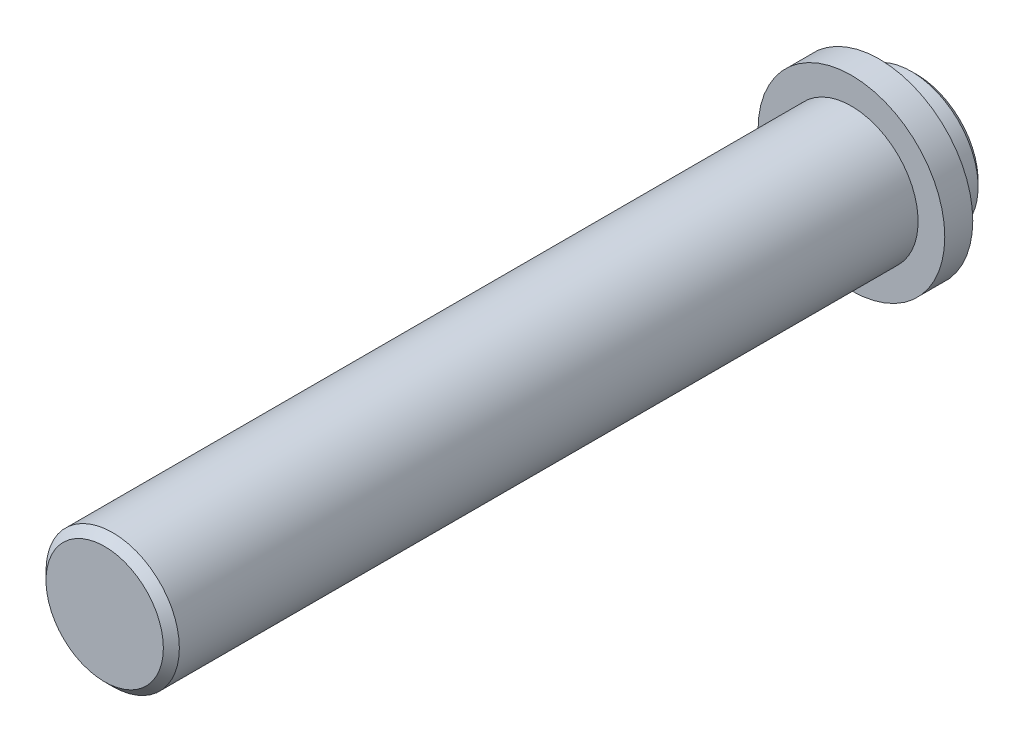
ISO-10303-21;
HEADER;
FILE_DESCRIPTION(('STEP AP214'),'2;1');
FILE_NAME('part.step','',(''),(''),'','','');
FILE_SCHEMA(('AUTOMOTIVE_DESIGN { 1 0 10303 214 1 1 1 1 }'));
ENDSEC;
DATA;
#1=APPLICATION_CONTEXT('core data for automotive mechanical design processes');
#2=APPLICATION_PROTOCOL_DEFINITION('international standard','automotive_design',2000,#1);
#3=PRODUCT_CONTEXT('',#1,'mechanical');
#4=PRODUCT('Part','Part','',(#3));
#5=PRODUCT_RELATED_PRODUCT_CATEGORY('part','',(#4));
#6=PRODUCT_DEFINITION_FORMATION('','',#4);
#7=PRODUCT_DEFINITION_CONTEXT('part definition',#1,'design');
#8=PRODUCT_DEFINITION('design','',#6,#7);
#9=PRODUCT_DEFINITION_SHAPE('','',#8);
#10=(LENGTH_UNIT() NAMED_UNIT(*) SI_UNIT(.MILLI.,.METRE.));
#11=(NAMED_UNIT(*) PLANE_ANGLE_UNIT() SI_UNIT($,.RADIAN.));
#12=(NAMED_UNIT(*) SI_UNIT($,.STERADIAN.) SOLID_ANGLE_UNIT());
#13=UNCERTAINTY_MEASURE_WITH_UNIT(LENGTH_MEASURE(1.E-05),#10,'distance_accuracy_value','');
#14=(GEOMETRIC_REPRESENTATION_CONTEXT(3) GLOBAL_UNCERTAINTY_ASSIGNED_CONTEXT((#13)) GLOBAL_UNIT_ASSIGNED_CONTEXT((#10,
#11,#12)) REPRESENTATION_CONTEXT('',''));
#15=CARTESIAN_POINT('',(0.,0.,0.));
#16=DIRECTION('',(0.,0.,1.));
#17=DIRECTION('',(1.,0.,0.));
#18=AXIS2_PLACEMENT_3D('',#15,#16,#17);
#19=CARTESIAN_POINT('',(0.,0.,-1.05));
#20=DIRECTION('',(0.,0.,-1.));
#21=DIRECTION('',(-1.,0.,0.));
#22=AXIS2_PLACEMENT_3D('',#19,#20,#21);
#23=CONICAL_SURFACE('',#22,1.5,0.785398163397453);
#24=CARTESIAN_POINT('',(-0.096702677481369,-1.6473641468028,-1.20020000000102));
#25=CARTESIAN_POINT('',(-0.141437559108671,-1.6235835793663,-1.17907878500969));
#26=CARTESIAN_POINT('',(-0.186830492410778,-1.59945319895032,-1.15957905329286));
#27=CARTESIAN_POINT('',(-0.278957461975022,-1.55047952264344,-1.12460601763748));
#28=CARTESIAN_POINT('',(-0.3256952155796,-1.52563425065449,-1.10914536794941));
#29=CARTESIAN_POINT('',(-0.419791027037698,-1.47561395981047,-1.08330353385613));
#30=CARTESIAN_POINT('',(-0.46713838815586,-1.45044462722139,-1.07287365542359));
#31=CARTESIAN_POINT('',(-0.562481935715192,-1.39976105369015,-1.05760327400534));
#32=CARTESIAN_POINT('',(-0.610477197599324,-1.37424730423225,-1.05275551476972));
#33=CARTESIAN_POINT('',(-0.70418135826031,-1.32443521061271,-1.04911164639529));
#34=CARTESIAN_POINT('',(-0.749881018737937,-1.30014177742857,-1.05001738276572));
#35=CARTESIAN_POINT('',(-0.840964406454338,-1.25172285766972,-1.05710786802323));
#36=CARTESIAN_POINT('',(-0.886347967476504,-1.22759745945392,-1.06329520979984));
#37=CARTESIAN_POINT('',(-1.02131955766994,-1.15584805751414,-1.08916841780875));
#38=CARTESIAN_POINT('',(-1.10986386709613,-1.10877888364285,-1.11616213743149));
#39=CARTESIAN_POINT('',(-1.21549251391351,-1.05262786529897,-1.15779675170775));
#40=CARTESIAN_POINT('',(-1.23486662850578,-1.04232880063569,-1.16583844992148));
#41=CARTESIAN_POINT('',(-1.27334689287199,-1.02187311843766,-1.18255570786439));
#42=CARTESIAN_POINT('',(-1.29245357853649,-1.01171621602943,-1.19122968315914));
#43=CARTESIAN_POINT('',(-1.31146313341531,-1.00161094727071,-1.20019999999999));
#44=B_SPLINE_CURVE_WITH_KNOTS('',3,(#24,#25,#26,#27,#28,#29,#30,#31,#32,#33,#34,#35,#36,#37,#38,
#39,#40,#41,#42,#43),.UNSPECIFIED.,.F.,.F.,(4,2,2,2,2,2,2,2,2,4),(0.,0.164736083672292,
0.3299822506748,0.493595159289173,0.656995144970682,0.811999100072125,0.967079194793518,
1.27678722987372,1.34689710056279,1.41683695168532),.UNSPECIFIED.);
#45=CARTESIAN_POINT('',(-0.0971264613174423,-1.64713886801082,-1.2));
#46=VERTEX_POINT('',#45);
#47=CARTESIAN_POINT('',(-1.31103934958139,-1.00183622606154,-1.2));
#48=VERTEX_POINT('',#47);
#49=EDGE_CURVE('E144',#46,#48,#44,.T.);
#50=ORIENTED_EDGE('',*,*,#49,.F.);
#51=CARTESIAN_POINT('',(0.,0.,-1.2));
#52=DIRECTION('',(0.,0.,-1.));
#53=DIRECTION('',(-1.,0.,0.));
#54=AXIS2_PLACEMENT_3D('',#51,#52,#53);
#55=CIRCLE('',#54,1.65);
#56=EDGE_CURVE('E254',#48,#46,#55,.F.);
#57=ORIENTED_EDGE('',*,*,#56,.F.);
#58=EDGE_LOOP('',(#50,#57));
#59=FACE_BOUND('',#58,.T.);
#60=ADVANCED_FACE('F30',(#59),#23,.F.);
#61=CARTESIAN_POINT('',(1.37830786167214,-0.907429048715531,-1.2002));
#62=CARTESIAN_POINT('',(1.33534584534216,-0.934280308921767,-1.17907878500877));
#63=CARTESIAN_POINT('',(1.29175185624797,-0.96152655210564,-1.15957905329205));
#64=CARTESIAN_POINT('',(1.20327592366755,-1.0168240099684,-1.12460601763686));
#65=CARTESIAN_POINT('',(1.15839041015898,-1.04487745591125,-1.10914536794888));
#66=CARTESIAN_POINT('',(1.06802366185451,-1.10135667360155,-1.08330353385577));
#67=CARTESIAN_POINT('',(1.02255269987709,-1.12977602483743,-1.07287365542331));
#68=CARTESIAN_POINT('',(0.930987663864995,-1.18700417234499,-1.0576032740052));
#69=CARTESIAN_POINT('',(0.884894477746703,-1.21581241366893,-1.05275551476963));
#70=CARTESIAN_POINT('',(0.794903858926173,-1.27205655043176,-1.04911164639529));
#71=CARTESIAN_POINT('',(0.751015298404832,-1.29948690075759,-1.05001738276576));
#72=CARTESIAN_POINT('',(0.663541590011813,-1.35415796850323,-1.05710786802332));
#73=CARTESIAN_POINT('',(0.619956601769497,-1.38139858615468,-1.06329520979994));
#74=CARTESIAN_POINT('',(0.490334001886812,-1.46241271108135,-1.08916841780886));
#75=CARTESIAN_POINT('',(0.405298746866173,-1.51555974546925,-1.11616213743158));
#76=CARTESIAN_POINT('',(0.303856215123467,-1.57896132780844,-1.15779675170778));
#77=CARTESIAN_POINT('',(0.285249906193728,-1.59059027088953,-1.16583844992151));
#78=CARTESIAN_POINT('',(0.248294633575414,-1.61368731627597,-1.18255570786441));
#79=CARTESIAN_POINT('',(0.229945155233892,-1.62515574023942,-1.19122968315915));
#80=CARTESIAN_POINT('',(0.211688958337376,-1.63656586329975,-1.20019999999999));
#81=B_SPLINE_CURVE_WITH_KNOTS('',3,(#61,#62,#63,#64,#65,#66,#67,#68,#69,#70,#71,#72,#73,#74,#75,
#76,#77,#78,#79,#80),.UNSPECIFIED.,.F.,.F.,(4,2,2,2,2,2,2,2,2,4),(0.,0.164736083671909,
0.329982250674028,0.493595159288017,0.656995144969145,0.811999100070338,0.967079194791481,
1.27678722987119,1.3468971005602,1.41683695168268),.UNSPECIFIED.);
#82=CARTESIAN_POINT('',(1.37790087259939,-0.907683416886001,-1.2));
#83=VERTEX_POINT('',#82);
#84=CARTESIAN_POINT('',(0.212095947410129,-1.63631149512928,-1.2));
#85=VERTEX_POINT('',#84);
#86=EDGE_CURVE('E286',#83,#85,#81,.T.);
#87=ORIENTED_EDGE('',*,*,#86,.F.);
#88=EDGE_CURVE('E329',#85,#83,#55,.F.);
#89=ORIENTED_EDGE('',*,*,#88,.F.);
#90=EDGE_LOOP('',(#87,#89));
#91=FACE_BOUND('',#90,.T.);
#92=ADVANCED_FACE('F342',(#91),#23,.F.);
#93=CARTESIAN_POINT('',(1.47501053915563,0.739935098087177,-1.20020000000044));
#94=CARTESIAN_POINT('',(1.47678340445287,0.689303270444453,-1.17907878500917));
#95=CARTESIAN_POINT('',(1.4785823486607,0.637926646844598,-1.1595790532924));
#96=CARTESIAN_POINT('',(1.48223338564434,0.533655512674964,-1.12460601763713));
#97=CARTESIAN_POINT('',(1.48408562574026,0.480756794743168,-1.10914536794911));
#98=CARTESIAN_POINT('',(1.4878146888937,0.374257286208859,-1.08330353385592));
#99=CARTESIAN_POINT('',(1.48969108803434,0.320668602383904,-1.07287365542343));
#100=CARTESIAN_POINT('',(1.49346959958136,0.212756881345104,-1.05760327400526));
#101=CARTESIAN_POINT('',(1.4953716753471,0.158434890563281,-1.05275551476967));
#102=CARTESIAN_POINT('',(1.49908521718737,0.0523786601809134,-1.04911164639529));
#103=CARTESIAN_POINT('',(1.50089631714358,0.000654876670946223,-1.05001738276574));
#104=CARTESIAN_POINT('',(1.50450599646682,-0.102435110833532,-1.05710786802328));
#105=CARTESIAN_POINT('',(1.50630456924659,-0.153801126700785,-1.0632952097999));
#106=CARTESIAN_POINT('',(1.51165355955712,-0.306564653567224,-1.08916841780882));
#107=CARTESIAN_POINT('',(1.51516261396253,-0.406780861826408,-1.11616213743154));
#108=CARTESIAN_POINT('',(1.51934872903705,-0.526333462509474,-1.15779675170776));
#109=CARTESIAN_POINT('',(1.52011653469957,-0.548261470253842,-1.1658384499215));
#110=CARTESIAN_POINT('',(1.52164152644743,-0.591814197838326,-1.18255570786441));
#111=CARTESIAN_POINT('',(1.52239873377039,-0.613439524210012,-1.19122968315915));
#112=CARTESIAN_POINT('',(1.52315209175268,-0.634954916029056,-1.2002));
#113=B_SPLINE_CURVE_WITH_KNOTS('',3,(#93,#94,#95,#96,#97,#98,#99,#100,#101,#102,#103,#104,#105,
#106,#107,#108,#109,#110,#111,#112),.UNSPECIFIED.,.F.,.F.,(4,2,2,2,2,2,2,2,2,4),(0.,
0.164736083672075,0.329982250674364,0.493595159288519,0.656995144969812,0.811999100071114,
0.967079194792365,1.27678722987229,1.34689710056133,1.41683695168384),.UNSPECIFIED.);
#114=CARTESIAN_POINT('',(1.47502733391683,0.739455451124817,-1.2));
#115=VERTEX_POINT('',#114);
#116=CARTESIAN_POINT('',(1.52313529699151,-0.634475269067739,-1.2));
#117=VERTEX_POINT('',#116);
#118=EDGE_CURVE('E292',#115,#117,#113,.T.);
#119=ORIENTED_EDGE('',*,*,#118,.F.);
#120=EDGE_CURVE('E326',#117,#115,#55,.F.);
#121=ORIENTED_EDGE('',*,*,#120,.F.);
#122=EDGE_LOOP('',(#119,#121));
#123=FACE_BOUND('',#122,.T.);
#124=ADVANCED_FACE('F345',(#123),#23,.F.);
#125=CARTESIAN_POINT('',(0.0967026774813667,1.6473641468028,-1.20020000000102));
#126=CARTESIAN_POINT('',(0.141437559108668,1.6235835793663,-1.17907878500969));
#127=CARTESIAN_POINT('',(0.186830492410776,1.59945319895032,-1.15957905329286));
#128=CARTESIAN_POINT('',(0.27895746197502,1.55047952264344,-1.12460601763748));
#129=CARTESIAN_POINT('',(0.325695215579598,1.52563425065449,-1.10914536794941));
#130=CARTESIAN_POINT('',(0.419791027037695,1.47561395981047,-1.08330353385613));
#131=CARTESIAN_POINT('',(0.467138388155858,1.45044462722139,-1.07287365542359));
#132=CARTESIAN_POINT('',(0.56248193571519,1.39976105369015,-1.05760327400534));
#133=CARTESIAN_POINT('',(0.610477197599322,1.37424730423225,-1.05275551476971));
#134=CARTESIAN_POINT('',(0.704181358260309,1.32443521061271,-1.04911164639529));
#135=CARTESIAN_POINT('',(0.749881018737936,1.30014177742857,-1.05001738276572));
#136=CARTESIAN_POINT('',(0.840964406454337,1.25172285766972,-1.05710786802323));
#137=CARTESIAN_POINT('',(0.886347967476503,1.22759745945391,-1.06329520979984));
#138=CARTESIAN_POINT('',(1.02131955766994,1.15584805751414,-1.08916841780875));
#139=CARTESIAN_POINT('',(1.10986386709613,1.10877888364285,-1.11616213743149));
#140=CARTESIAN_POINT('',(1.21549251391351,1.05262786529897,-1.15779675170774));
#141=CARTESIAN_POINT('',(1.23486662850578,1.04232880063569,-1.16583844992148));
#142=CARTESIAN_POINT('',(1.27334689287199,1.02187311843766,-1.18255570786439));
#143=CARTESIAN_POINT('',(1.29245357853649,1.01171621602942,-1.19122968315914));
#144=CARTESIAN_POINT('',(1.31146313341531,1.0016109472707,-1.20019999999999));
#145=B_SPLINE_CURVE_WITH_KNOTS('',3,(#125,#126,#127,#128,#129,#130,#131,#132,#133,#134,#135,
#136,#137,#138,#139,#140,#141,#142,#143,#144),.UNSPECIFIED.,.F.,.F.,(4,2,2,2,2,2,2,2,2,4),(0.,
0.164736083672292,0.3299822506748,0.493595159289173,0.656995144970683,0.811999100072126,
0.967079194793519,1.27678722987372,1.34689710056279,1.41683695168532),.UNSPECIFIED.);
#146=CARTESIAN_POINT('',(0.0971264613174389,1.64713886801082,-1.2));
#147=VERTEX_POINT('',#146);
#148=CARTESIAN_POINT('',(1.31103934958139,1.00183622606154,-1.2));
#149=VERTEX_POINT('',#148);
#150=EDGE_CURVE('E310',#147,#149,#145,.T.);
#151=ORIENTED_EDGE('',*,*,#150,.F.);
#152=EDGE_CURVE('E325',#149,#147,#55,.F.);
#153=ORIENTED_EDGE('',*,*,#152,.F.);
#154=EDGE_LOOP('',(#151,#153));
#155=FACE_BOUND('',#154,.T.);
#156=ADVANCED_FACE('F349',(#155),#23,.F.);
#157=CARTESIAN_POINT('',(-1.37830786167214,0.907429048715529,-1.2002));
#158=CARTESIAN_POINT('',(-1.33534584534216,0.934280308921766,-1.17907878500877));
#159=CARTESIAN_POINT('',(-1.29175185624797,0.961526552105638,-1.15957905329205));
#160=CARTESIAN_POINT('',(-1.20327592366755,1.0168240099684,-1.12460601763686));
#161=CARTESIAN_POINT('',(-1.15839041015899,1.04487745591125,-1.10914536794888));
#162=CARTESIAN_POINT('',(-1.06802366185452,1.10135667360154,-1.08330353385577));
#163=CARTESIAN_POINT('',(-1.0225526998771,1.12977602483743,-1.07287365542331));
#164=CARTESIAN_POINT('',(-0.930987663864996,1.18700417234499,-1.0576032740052));
#165=CARTESIAN_POINT('',(-0.884894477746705,1.21581241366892,-1.05275551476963));
#166=CARTESIAN_POINT('',(-0.794903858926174,1.27205655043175,-1.04911164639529));
#167=CARTESIAN_POINT('',(-0.751015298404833,1.29948690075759,-1.05001738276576));
#168=CARTESIAN_POINT('',(-0.663541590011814,1.35415796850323,-1.05710786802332));
#169=CARTESIAN_POINT('',(-0.619956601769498,1.38139858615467,-1.06329520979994));
#170=CARTESIAN_POINT('',(-0.490334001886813,1.46241271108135,-1.08916841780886));
#171=CARTESIAN_POINT('',(-0.405298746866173,1.51555974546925,-1.11616213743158));
#172=CARTESIAN_POINT('',(-0.303856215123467,1.57896132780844,-1.15779675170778));
#173=CARTESIAN_POINT('',(-0.285249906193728,1.59059027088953,-1.16583844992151));
#174=CARTESIAN_POINT('',(-0.248294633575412,1.61368731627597,-1.18255570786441));
#175=CARTESIAN_POINT('',(-0.22994515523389,1.62515574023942,-1.19122968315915));
#176=CARTESIAN_POINT('',(-0.211688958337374,1.63656586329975,-1.20019999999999));
#177=B_SPLINE_CURVE_WITH_KNOTS('',3,(#157,#158,#159,#160,#161,#162,#163,#164,#165,#166,#167,
#168,#169,#170,#171,#172,#173,#174,#175,#176),.UNSPECIFIED.,.F.,.F.,(4,2,2,2,2,2,2,2,2,4),(0.,
0.164736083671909,0.329982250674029,0.493595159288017,0.656995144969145,0.811999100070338,
0.967079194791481,1.27678722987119,1.3468971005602,1.41683695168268),.UNSPECIFIED.);
#178=CARTESIAN_POINT('',(-1.37790087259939,0.907683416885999,-1.2));
#179=VERTEX_POINT('',#178);
#180=CARTESIAN_POINT('',(-0.212095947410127,1.63631149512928,-1.2));
#181=VERTEX_POINT('',#180);
#182=EDGE_CURVE('E262',#179,#181,#177,.T.);
#183=ORIENTED_EDGE('',*,*,#182,.F.);
#184=EDGE_CURVE('E253',#181,#179,#55,.F.);
#185=ORIENTED_EDGE('',*,*,#184,.F.);
#186=EDGE_LOOP('',(#183,#185));
#187=FACE_BOUND('',#186,.T.);
#188=ADVANCED_FACE('F324',(#187),#23,.F.);
#189=CARTESIAN_POINT('',(0.,0.,-1.05));
#190=DIRECTION('',(0.,0.,-1.));
#191=DIRECTION('',(-1.,0.,0.));
#192=AXIS2_PLACEMENT_3D('',#189,#190,#191);
#193=PLANE('',#192);
#194=CARTESIAN_POINT('',(0.,0.,-1.05));
#195=DIRECTION('',(0.,0.,-1.));
#196=DIRECTION('',(-1.,0.,0.));
#197=AXIS2_PLACEMENT_3D('',#194,#195,#196);
#198=CIRCLE('',#197,3.5);
#199=CARTESIAN_POINT('',(-3.5,0.,-1.05));
#200=VERTEX_POINT('',#199);
#201=EDGE_CURVE('E234',#200,#200,#198,.T.);
#202=ORIENTED_EDGE('',*,*,#201,.T.);
#203=EDGE_LOOP('',(#202));
#204=FACE_BOUND('',#203,.T.);
#205=CARTESIAN_POINT('',(0.,0.,-1.05));
#206=DIRECTION('',(0.,0.,-1.));
#207=DIRECTION('',(-1.,0.,0.));
#208=AXIS2_PLACEMENT_3D('',#205,#206,#207);
#209=CIRCLE('',#208,2.5);
#210=CARTESIAN_POINT('',(-2.5,0.,-1.05));
#211=VERTEX_POINT('',#210);
#212=EDGE_CURVE('E228',#211,#211,#209,.T.);
#213=ORIENTED_EDGE('',*,*,#212,.F.);
#214=EDGE_LOOP('',(#213));
#215=FACE_BOUND('',#214,.T.);
#216=ADVANCED_FACE('F392',(#204,#215),#193,.T.);
#217=CARTESIAN_POINT('',(0.,0.,28.));
#218=DIRECTION('',(0.,0.,-1.));
#219=DIRECTION('',(-1.,0.,0.));
#220=AXIS2_PLACEMENT_3D('',#217,#218,#219);
#221=CYLINDRICAL_SURFACE('',#220,2.5);
#222=CARTESIAN_POINT('',(0.,0.,27.7));
#223=DIRECTION('',(0.,0.,1.));
#224=DIRECTION('',(1.,0.,0.));
#225=AXIS2_PLACEMENT_3D('',#222,#223,#224);
#226=CIRCLE('',#225,2.5);
#227=CARTESIAN_POINT('',(2.5,0.,27.7));
#228=VERTEX_POINT('',#227);
#229=EDGE_CURVE('E243',#228,#228,#226,.F.);
#230=ORIENTED_EDGE('',*,*,#229,.T.);
#231=EDGE_LOOP('',(#230));
#232=FACE_BOUND('',#231,.T.);
#233=CARTESIAN_POINT('',(0.,0.,0.));
#234=DIRECTION('',(0.,0.,-1.));
#235=DIRECTION('',(-1.,0.,0.));
#236=AXIS2_PLACEMENT_3D('',#233,#234,#235);
#237=CIRCLE('',#236,2.5);
#238=CARTESIAN_POINT('',(-2.5,0.,0.));
#239=VERTEX_POINT('',#238);
#240=EDGE_CURVE('E237',#239,#239,#237,.T.);
#241=ORIENTED_EDGE('',*,*,#240,.F.);
#242=EDGE_LOOP('',(#241));
#243=FACE_BOUND('',#242,.T.);
#244=ADVANCED_FACE('F32',(#232,#243),#221,.T.);
#245=CARTESIAN_POINT('',(0.,0.,28.));
#246=DIRECTION('',(0.,0.,1.));
#247=DIRECTION('',(1.,0.,0.));
#248=AXIS2_PLACEMENT_3D('',#245,#246,#247);
#249=PLANE('',#248);
#250=CARTESIAN_POINT('',(0.,0.,28.));
#251=DIRECTION('',(0.,0.,1.));
#252=DIRECTION('',(1.,0.,0.));
#253=AXIS2_PLACEMENT_3D('',#250,#251,#252);
#254=CIRCLE('',#253,2.2);
#255=CARTESIAN_POINT('',(2.2,0.,28.));
#256=VERTEX_POINT('',#255);
#257=EDGE_CURVE('E240',#256,#256,#254,.T.);
#258=ORIENTED_EDGE('',*,*,#257,.T.);
#259=EDGE_LOOP('',(#258));
#260=FACE_BOUND('',#259,.T.);
#261=ADVANCED_FACE('F535',(#260),#249,.T.);
#262=CARTESIAN_POINT('',(0.,0.,0.));
#263=DIRECTION('',(0.,0.,-1.));
#264=DIRECTION('',(-1.,0.,0.));
#265=AXIS2_PLACEMENT_3D('',#262,#263,#264);
#266=PLANE('',#265);
#267=CARTESIAN_POINT('',(0.,0.,0.));
#268=DIRECTION('',(0.,0.,-1.));
#269=DIRECTION('',(-1.,0.,0.));
#270=AXIS2_PLACEMENT_3D('',#267,#268,#269);
#271=CIRCLE('',#270,3.5);
#272=CARTESIAN_POINT('',(-3.5,0.,0.));
#273=VERTEX_POINT('',#272);
#274=EDGE_CURVE('E231',#273,#273,#271,.T.);
#275=ORIENTED_EDGE('',*,*,#274,.F.);
#276=EDGE_LOOP('',(#275));
#277=FACE_BOUND('',#276,.T.);
#278=ORIENTED_EDGE('',*,*,#240,.T.);
#279=EDGE_LOOP('',(#278));
#280=FACE_BOUND('',#279,.T.);
#281=ADVANCED_FACE('F527',(#277,#280),#266,.F.);
#282=CARTESIAN_POINT('',(0.,0.,-1.05));
#283=DIRECTION('',(0.,0.,1.));
#284=DIRECTION('',(1.,0.,0.));
#285=AXIS2_PLACEMENT_3D('',#282,#283,#284);
#286=CYLINDRICAL_SURFACE('',#285,3.5);
#287=ORIENTED_EDGE('',*,*,#201,.F.);
#288=EDGE_LOOP('',(#287));
#289=FACE_BOUND('',#288,.T.);
#290=ORIENTED_EDGE('',*,*,#274,.T.);
#291=EDGE_LOOP('',(#290));
#292=FACE_BOUND('',#291,.T.);
#293=ADVANCED_FACE('F514',(#289,#292),#286,.T.);
#294=CARTESIAN_POINT('',(0.,0.,-2.45));
#295=DIRECTION('',(0.,0.,1.));
#296=DIRECTION('',(1.,0.,0.));
#297=AXIS2_PLACEMENT_3D('',#294,#295,#296);
#298=CYLINDRICAL_SURFACE('',#297,2.5);
#299=CARTESIAN_POINT('',(0.,0.,-2.25));
#300=DIRECTION('',(0.,0.,-1.));
#301=DIRECTION('',(-1.,0.,0.));
#302=AXIS2_PLACEMENT_3D('',#299,#300,#301);
#303=CIRCLE('',#302,2.5);
#304=CARTESIAN_POINT('',(-2.5,0.,-2.25));
#305=VERTEX_POINT('',#304);
#306=EDGE_CURVE('E249',#305,#305,#303,.F.);
#307=ORIENTED_EDGE('',*,*,#306,.T.);
#308=EDGE_LOOP('',(#307));
#309=FACE_BOUND('',#308,.T.);
#310=ORIENTED_EDGE('',*,*,#212,.T.);
#311=EDGE_LOOP('',(#310));
#312=FACE_BOUND('',#311,.T.);
#313=ADVANCED_FACE('F506',(#309,#312),#298,.T.);
#314=CARTESIAN_POINT('',(0.,0.,-2.45));
#315=DIRECTION('',(0.,0.,-1.));
#316=DIRECTION('',(-1.,0.,0.));
#317=AXIS2_PLACEMENT_3D('',#314,#315,#316);
#318=PLANE('',#317);
#319=CARTESIAN_POINT('',(0.,0.,-2.45));
#320=DIRECTION('',(0.,0.,-1.));
#321=DIRECTION('',(-1.,0.,0.));
#322=AXIS2_PLACEMENT_3D('',#319,#320,#321);
#323=CIRCLE('',#322,1.75);
#324=CARTESIAN_POINT('',(-1.75,0.,-2.45));
#325=VERTEX_POINT('',#324);
#326=EDGE_CURVE('E222',#325,#325,#323,.T.);
#327=ORIENTED_EDGE('',*,*,#326,.F.);
#328=EDGE_LOOP('',(#327));
#329=FACE_BOUND('',#328,.T.);
#330=CARTESIAN_POINT('',(0.,0.,-2.45));
#331=DIRECTION('',(0.,0.,-1.));
#332=DIRECTION('',(-1.,0.,0.));
#333=AXIS2_PLACEMENT_3D('',#330,#331,#332);
#334=CIRCLE('',#333,2.3);
#335=CARTESIAN_POINT('',(-2.3,0.,-2.45));
#336=VERTEX_POINT('',#335);
#337=EDGE_CURVE('E246',#336,#336,#334,.T.);
#338=ORIENTED_EDGE('',*,*,#337,.T.);
#339=EDGE_LOOP('',(#338));
#340=FACE_BOUND('',#339,.T.);
#341=ADVANCED_FACE('F498',(#329,#340),#318,.T.);
#342=CARTESIAN_POINT('',(0.,0.,28.));
#343=DIRECTION('',(0.,0.,-1.));
#344=DIRECTION('',(-1.,0.,0.));
#345=AXIS2_PLACEMENT_3D('',#342,#343,#344);
#346=CONICAL_SURFACE('',#345,2.2,0.785398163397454);
#347=ORIENTED_EDGE('',*,*,#229,.F.);
#348=EDGE_LOOP('',(#347));
#349=FACE_BOUND('',#348,.T.);
#350=ORIENTED_EDGE('',*,*,#257,.F.);
#351=EDGE_LOOP('',(#350));
#352=FACE_BOUND('',#351,.T.);
#353=ADVANCED_FACE('F490',(#349,#352),#346,.T.);
#354=CARTESIAN_POINT('',(0.,0.,-2.45));
#355=DIRECTION('',(0.,0.,1.));
#356=DIRECTION('',(1.,0.,0.));
#357=AXIS2_PLACEMENT_3D('',#354,#355,#356);
#358=CONICAL_SURFACE('',#357,2.3,0.785398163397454);
#359=ORIENTED_EDGE('',*,*,#306,.F.);
#360=EDGE_LOOP('',(#359));
#361=FACE_BOUND('',#360,.T.);
#362=ORIENTED_EDGE('',*,*,#337,.F.);
#363=EDGE_LOOP('',(#362));
#364=FACE_BOUND('',#363,.T.);
#365=ADVANCED_FACE('F482',(#361,#364),#358,.T.);
#366=CARTESIAN_POINT('',(0.,0.,-1.2));
#367=DIRECTION('',(0.,0.,-1.));
#368=DIRECTION('',(-1.,0.,0.));
#369=AXIS2_PLACEMENT_3D('',#366,#367,#368);
#370=CYLINDRICAL_SURFACE('',#369,1.75);
#371=CARTESIAN_POINT('',(0.,0.,-1.2));
#372=DIRECTION('',(0.,0.,-1.));
#373=DIRECTION('',(-1.,0.,0.));
#374=AXIS2_PLACEMENT_3D('',#371,#372,#373);
#375=CIRCLE('',#374,1.75);
#376=CARTESIAN_POINT('',(-1.75,0.,-1.2));
#377=VERTEX_POINT('',#376);
#378=EDGE_CURVE('E225',#377,#377,#375,.T.);
#379=ORIENTED_EDGE('',*,*,#378,.F.);
#380=EDGE_LOOP('',(#379));
#381=FACE_BOUND('',#380,.T.);
#382=ORIENTED_EDGE('',*,*,#326,.T.);
#383=EDGE_LOOP('',(#382));
#384=FACE_BOUND('',#383,.T.);
#385=ADVANCED_FACE('F389',(#381,#384),#370,.F.);
#386=CARTESIAN_POINT('',(0.,0.,-1.2));
#387=DIRECTION('',(0.,0.,-1.));
#388=DIRECTION('',(-1.,0.,0.));
#389=AXIS2_PLACEMENT_3D('',#386,#387,#388);
#390=PLANE('',#389);
#391=DIRECTION('',(-0.882991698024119,0.469388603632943,0.));
#392=VECTOR('',#391,1.);
#393=CARTESIAN_POINT('',(0.060610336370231,-1.73099000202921,-1.2));
#394=LINE('',#393,#392);
#395=CARTESIAN_POINT('',(0.060610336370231,-1.73099000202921,-1.2));
#396=VERTEX_POINT('',#395);
#397=EDGE_CURVE('E149',#396,#46,#394,.T.);
#398=ORIENTED_EDGE('',*,*,#397,.F.);
#399=DIRECTION('',(-0.847998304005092,-0.529998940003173,0.));
#400=VECTOR('',#399,1.);
#401=CARTESIAN_POINT('',(1.52938648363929,-0.813004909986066,-1.2));
#402=LINE('',#401,#400);
#403=EDGE_CURVE('E181',#85,#396,#402,.T.);
#404=ORIENTED_EDGE('',*,*,#403,.F.);
#405=ORIENTED_EDGE('',*,*,#88,.T.);
#406=CARTESIAN_POINT('',(1.52938648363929,-0.813004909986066,-1.2));
#407=VERTEX_POINT('',#406);
#408=EDGE_CURVE('E182',#407,#83,#402,.T.);
#409=ORIENTED_EDGE('',*,*,#408,.F.);
#410=DIRECTION('',(0.0349933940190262,-0.999387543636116,0.));
#411=VECTOR('',#410,1.);
#412=CARTESIAN_POINT('',(1.46877614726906,0.917985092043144,-1.2));
#413=LINE('',#412,#411);
#414=EDGE_CURVE('E177',#117,#407,#413,.T.);
#415=ORIENTED_EDGE('',*,*,#414,.F.);
#416=ORIENTED_EDGE('',*,*,#120,.T.);
#417=CARTESIAN_POINT('',(1.46877614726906,0.917985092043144,-1.2));
#418=VERTEX_POINT('',#417);
#419=EDGE_CURVE('E178',#418,#115,#413,.T.);
#420=ORIENTED_EDGE('',*,*,#419,.F.);
#421=DIRECTION('',(0.882991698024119,-0.469388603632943,0.));
#422=VECTOR('',#421,1.);
#423=CARTESIAN_POINT('',(-0.060610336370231,1.73099000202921,-1.2));
#424=LINE('',#423,#422);
#425=EDGE_CURVE('E173',#149,#418,#424,.T.);
#426=ORIENTED_EDGE('',*,*,#425,.F.);
#427=ORIENTED_EDGE('',*,*,#152,.T.);
#428=CARTESIAN_POINT('',(-0.060610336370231,1.73099000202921,-1.2));
#429=VERTEX_POINT('',#428);
#430=EDGE_CURVE('E174',#429,#147,#424,.T.);
#431=ORIENTED_EDGE('',*,*,#430,.F.);
#432=DIRECTION('',(0.847998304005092,0.529998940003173,0.));
#433=VECTOR('',#432,1.);
#434=CARTESIAN_POINT('',(-1.52938648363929,0.813004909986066,-1.2));
#435=LINE('',#434,#433);
#436=EDGE_CURVE('E166',#181,#429,#435,.T.);
#437=ORIENTED_EDGE('',*,*,#436,.F.);
#438=ORIENTED_EDGE('',*,*,#184,.T.);
#439=CARTESIAN_POINT('',(-1.52938648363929,0.813004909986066,-1.2));
#440=VERTEX_POINT('',#439);
#441=EDGE_CURVE('E169',#440,#179,#435,.T.);
#442=ORIENTED_EDGE('',*,*,#441,.F.);
#443=DIRECTION('',(-0.0349933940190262,0.999387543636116,0.));
#444=VECTOR('',#443,1.);
#445=CARTESIAN_POINT('',(-1.46877614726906,-0.917985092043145,-1.2));
#446=LINE('',#445,#444);
#447=CARTESIAN_POINT('',(-1.52313529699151,0.63447526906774,-1.2));
#448=VERTEX_POINT('',#447);
#449=EDGE_CURVE('E167',#448,#440,#446,.T.);
#450=ORIENTED_EDGE('',*,*,#449,.F.);
#451=CARTESIAN_POINT('',(-1.47502733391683,-0.739455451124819,-1.2));
#452=VERTEX_POINT('',#451);
#453=EDGE_CURVE('E165',#448,#452,#55,.F.);
#454=ORIENTED_EDGE('',*,*,#453,.T.);
#455=CARTESIAN_POINT('',(-1.46877614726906,-0.917985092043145,-1.2));
#456=VERTEX_POINT('',#455);
#457=EDGE_CURVE('E154',#456,#452,#446,.T.);
#458=ORIENTED_EDGE('',*,*,#457,.F.);
#459=EDGE_CURVE('E138',#48,#456,#394,.T.);
#460=ORIENTED_EDGE('',*,*,#459,.F.);
#461=ORIENTED_EDGE('',*,*,#56,.T.);
#462=EDGE_LOOP('',(#398,#404,#405,#409,#415,#416,#420,#426,#427,#431,#437,#438,#442,#450,#454,
#458,#460,#461));
#463=FACE_BOUND('',#462,.T.);
#464=ORIENTED_EDGE('',*,*,#378,.T.);
#465=EDGE_LOOP('',(#464));
#466=FACE_BOUND('',#465,.T.);
#467=ADVANCED_FACE('F161',(#463,#466),#390,.T.);
#468=CARTESIAN_POINT('',(-1.47501053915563,-0.739935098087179,-1.20020000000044));
#469=CARTESIAN_POINT('',(-1.47678340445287,-0.689303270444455,-1.17907878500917));
#470=CARTESIAN_POINT('',(-1.47858234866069,-0.6379266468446,-1.1595790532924));
#471=CARTESIAN_POINT('',(-1.48223338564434,-0.533655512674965,-1.12460601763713));
#472=CARTESIAN_POINT('',(-1.48408562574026,-0.480756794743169,-1.10914536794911));
#473=CARTESIAN_POINT('',(-1.48781468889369,-0.37425728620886,-1.08330353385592));
#474=CARTESIAN_POINT('',(-1.48969108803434,-0.320668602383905,-1.07287365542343));
#475=CARTESIAN_POINT('',(-1.49346959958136,-0.212756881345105,-1.05760327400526));
#476=CARTESIAN_POINT('',(-1.4953716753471,-0.158434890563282,-1.05275551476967));
#477=CARTESIAN_POINT('',(-1.49908521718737,-0.0523786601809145,-1.04911164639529));
#478=CARTESIAN_POINT('',(-1.50089631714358,-0.00065487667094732,-1.05001738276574));
#479=CARTESIAN_POINT('',(-1.50450599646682,0.102435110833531,-1.05710786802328));
#480=CARTESIAN_POINT('',(-1.50630456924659,0.153801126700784,-1.0632952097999));
#481=CARTESIAN_POINT('',(-1.51165355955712,0.306564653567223,-1.08916841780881));
#482=CARTESIAN_POINT('',(-1.51516261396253,0.406780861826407,-1.11616213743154));
#483=CARTESIAN_POINT('',(-1.51934872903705,0.526333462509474,-1.15779675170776));
#484=CARTESIAN_POINT('',(-1.52011653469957,0.548261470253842,-1.1658384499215));
#485=CARTESIAN_POINT('',(-1.52164152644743,0.591814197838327,-1.18255570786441));
#486=CARTESIAN_POINT('',(-1.52239873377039,0.613439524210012,-1.19122968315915));
#487=CARTESIAN_POINT('',(-1.52315209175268,0.634954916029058,-1.2002));
#488=B_SPLINE_CURVE_WITH_KNOTS('',3,(#468,#469,#470,#471,#472,#473,#474,#475,#476,#477,#478,
#479,#480,#481,#482,#483,#484,#485,#486,#487),.UNSPECIFIED.,.F.,.F.,(4,2,2,2,2,2,2,2,2,4),(0.,
0.164736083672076,0.329982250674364,0.493595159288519,0.656995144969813,0.811999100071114,
0.967079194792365,1.27678722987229,1.34689710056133,1.41683695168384),.UNSPECIFIED.);
#489=EDGE_CURVE('E255',#452,#448,#488,.T.);
#490=ORIENTED_EDGE('',*,*,#489,.F.);
#491=ORIENTED_EDGE('',*,*,#453,.F.);
#492=EDGE_LOOP('',(#490,#491));
#493=FACE_BOUND('',#492,.T.);
#494=ADVANCED_FACE('F268',(#493),#23,.F.);
#495=CARTESIAN_POINT('',(0.0606103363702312,-1.73099000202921,3.8));
#496=DIRECTION('',(0.,0.,1.));
#497=DIRECTION('',(1.,0.,0.));
#498=AXIS2_PLACEMENT_3D('',#495,#496,#497);
#499=PLANE('',#498);
#500=DIRECTION('',(-0.847998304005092,-0.529998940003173,0.));
#501=VECTOR('',#500,1.);
#502=CARTESIAN_POINT('',(1.52938648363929,-0.813004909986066,3.8));
#503=LINE('',#502,#501);
#504=CARTESIAN_POINT('',(0.79499841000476,-1.27199745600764,3.8));
#505=VERTEX_POINT('',#504);
#506=CARTESIAN_POINT('',(0.060610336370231,-1.73099000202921,3.8));
#507=VERTEX_POINT('',#506);
#508=EDGE_CURVE('E203',#505,#507,#503,.T.);
#509=ORIENTED_EDGE('',*,*,#508,.T.);
#510=DIRECTION('',(-0.882991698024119,0.469388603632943,0.));
#511=VECTOR('',#510,1.);
#512=CARTESIAN_POINT('',(0.060610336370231,-1.73099000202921,3.8));
#513=LINE('',#512,#511);
#514=CARTESIAN_POINT('',(-0.704082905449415,-1.32448754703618,3.8));
#515=VERTEX_POINT('',#514);
#516=EDGE_CURVE('E186',#507,#515,#513,.T.);
#517=ORIENTED_EDGE('',*,*,#516,.T.);
#518=CARTESIAN_POINT('',(0.,0.,3.8));
#519=DIRECTION('',(0.,0.,1.));
#520=DIRECTION('',(1.,0.,0.));
#521=AXIS2_PLACEMENT_3D('',#518,#519,#520);
#522=CIRCLE('',#521,1.5);
#523=EDGE_CURVE('E11',#505,#515,#522,.F.);
#524=ORIENTED_EDGE('',*,*,#523,.F.);
#525=EDGE_LOOP('',(#509,#517,#524));
#526=FACE_BOUND('',#525,.T.);
#527=ADVANCED_FACE('F302',(#526),#499,.F.);
#528=CARTESIAN_POINT('',(-1.46877614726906,-0.917985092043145,3.8));
#529=VERTEX_POINT('',#528);
#530=EDGE_CURVE('E185',#515,#529,#513,.T.);
#531=ORIENTED_EDGE('',*,*,#530,.T.);
#532=DIRECTION('',(-0.0349933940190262,0.999387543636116,0.));
#533=VECTOR('',#532,1.);
#534=CARTESIAN_POINT('',(-1.46877614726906,-0.917985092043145,3.8));
#535=LINE('',#534,#533);
#536=CARTESIAN_POINT('',(-1.49908131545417,-0.0524900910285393,3.8));
#537=VERTEX_POINT('',#536);
#538=EDGE_CURVE('E157',#529,#537,#535,.T.);
#539=ORIENTED_EDGE('',*,*,#538,.T.);
#540=EDGE_CURVE('E39',#515,#537,#522,.F.);
#541=ORIENTED_EDGE('',*,*,#540,.F.);
#542=EDGE_LOOP('',(#531,#539,#541));
#543=FACE_BOUND('',#542,.T.);
#544=ADVANCED_FACE('F377',(#543),#499,.F.);
#545=CARTESIAN_POINT('',(-1.52938648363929,0.813004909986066,3.8));
#546=VERTEX_POINT('',#545);
#547=EDGE_CURVE('E189',#537,#546,#535,.T.);
#548=ORIENTED_EDGE('',*,*,#547,.T.);
#549=DIRECTION('',(0.847998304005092,0.529998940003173,0.));
#550=VECTOR('',#549,1.);
#551=CARTESIAN_POINT('',(-1.52938648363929,0.813004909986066,3.8));
#552=LINE('',#551,#550);
#553=CARTESIAN_POINT('',(-0.79499841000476,1.27199745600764,3.8));
#554=VERTEX_POINT('',#553);
#555=EDGE_CURVE('E192',#546,#554,#552,.T.);
#556=ORIENTED_EDGE('',*,*,#555,.T.);
#557=EDGE_CURVE('E358',#537,#554,#522,.F.);
#558=ORIENTED_EDGE('',*,*,#557,.F.);
#559=EDGE_LOOP('',(#548,#556,#558));
#560=FACE_BOUND('',#559,.T.);
#561=ADVANCED_FACE('F357',(#560),#499,.F.);
#562=CARTESIAN_POINT('',(-0.060610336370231,1.73099000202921,3.8));
#563=VERTEX_POINT('',#562);
#564=EDGE_CURVE('E191',#554,#563,#552,.T.);
#565=ORIENTED_EDGE('',*,*,#564,.T.);
#566=DIRECTION('',(0.882991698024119,-0.469388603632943,0.));
#567=VECTOR('',#566,1.);
#568=CARTESIAN_POINT('',(-0.060610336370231,1.73099000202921,3.8));
#569=LINE('',#568,#567);
#570=CARTESIAN_POINT('',(0.704082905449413,1.32448754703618,3.8));
#571=VERTEX_POINT('',#570);
#572=EDGE_CURVE('E196',#563,#571,#569,.T.);
#573=ORIENTED_EDGE('',*,*,#572,.T.);
#574=EDGE_CURVE('E366',#554,#571,#522,.F.);
#575=ORIENTED_EDGE('',*,*,#574,.F.);
#576=EDGE_LOOP('',(#565,#573,#575));
#577=FACE_BOUND('',#576,.T.);
#578=ADVANCED_FACE('F371',(#577),#499,.F.);
#579=CARTESIAN_POINT('',(1.46877614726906,0.917985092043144,3.8));
#580=VERTEX_POINT('',#579);
#581=EDGE_CURVE('E195',#571,#580,#569,.T.);
#582=ORIENTED_EDGE('',*,*,#581,.T.);
#583=DIRECTION('',(0.0349933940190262,-0.999387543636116,0.));
#584=VECTOR('',#583,1.);
#585=CARTESIAN_POINT('',(1.46877614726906,0.917985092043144,3.8));
#586=LINE('',#585,#584);
#587=CARTESIAN_POINT('',(1.49908131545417,0.0524900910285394,3.8));
#588=VERTEX_POINT('',#587);
#589=EDGE_CURVE('E200',#580,#588,#586,.T.);
#590=ORIENTED_EDGE('',*,*,#589,.T.);
#591=EDGE_CURVE('E367',#571,#588,#522,.F.);
#592=ORIENTED_EDGE('',*,*,#591,.F.);
#593=EDGE_LOOP('',(#582,#590,#592));
#594=FACE_BOUND('',#593,.T.);
#595=ADVANCED_FACE('F370',(#594),#499,.F.);
#596=CARTESIAN_POINT('',(1.52938648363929,-0.813004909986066,3.8));
#597=VERTEX_POINT('',#596);
#598=EDGE_CURVE('E199',#588,#597,#586,.T.);
#599=ORIENTED_EDGE('',*,*,#598,.T.);
#600=EDGE_CURVE('E46',#597,#505,#503,.T.);
#601=ORIENTED_EDGE('',*,*,#600,.T.);
#602=EDGE_CURVE('E34',#588,#505,#522,.F.);
#603=ORIENTED_EDGE('',*,*,#602,.F.);
#604=EDGE_LOOP('',(#599,#601,#603));
#605=FACE_BOUND('',#604,.T.);
#606=ADVANCED_FACE('F281',(#605),#499,.F.);
#607=CARTESIAN_POINT('',(0.060610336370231,-1.73099000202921,3.8));
#608=DIRECTION('',(-0.469388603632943,-0.882991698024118,0.));
#609=DIRECTION('',(0.882991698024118,-0.469388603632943,0.));
#610=AXIS2_PLACEMENT_3D('',#607,#608,#609);
#611=PLANE('',#610);
#612=ORIENTED_EDGE('',*,*,#49,.T.);
#613=ORIENTED_EDGE('',*,*,#459,.T.);
#614=DIRECTION('',(0.,0.,-1.));
#615=VECTOR('',#614,1.);
#616=CARTESIAN_POINT('',(-1.46877614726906,-0.917985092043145,3.8));
#617=LINE('',#616,#615);
#618=EDGE_CURVE('E141',#529,#456,#617,.T.);
#619=ORIENTED_EDGE('',*,*,#618,.F.);
#620=ORIENTED_EDGE('',*,*,#530,.F.);
#621=ORIENTED_EDGE('',*,*,#516,.F.);
#622=DIRECTION('',(0.,0.,-1.));
#623=VECTOR('',#622,1.);
#624=CARTESIAN_POINT('',(0.060610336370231,-1.73099000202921,3.8));
#625=LINE('',#624,#623);
#626=EDGE_CURVE('E205',#507,#396,#625,.T.);
#627=ORIENTED_EDGE('',*,*,#626,.T.);
#628=ORIENTED_EDGE('',*,*,#397,.T.);
#629=EDGE_LOOP('',(#612,#613,#619,#620,#621,#627,#628));
#630=FACE_BOUND('',#629,.T.);
#631=ADVANCED_FACE('F140',(#630),#611,.F.);
#632=CARTESIAN_POINT('',(1.52938648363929,-0.813004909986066,3.8));
#633=DIRECTION('',(0.529998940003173,-0.847998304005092,0.));
#634=DIRECTION('',(0.847998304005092,0.529998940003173,0.));
#635=AXIS2_PLACEMENT_3D('',#632,#633,#634);
#636=PLANE('',#635);
#637=ORIENTED_EDGE('',*,*,#86,.T.);
#638=ORIENTED_EDGE('',*,*,#403,.T.);
#639=ORIENTED_EDGE('',*,*,#626,.F.);
#640=ORIENTED_EDGE('',*,*,#508,.F.);
#641=ORIENTED_EDGE('',*,*,#600,.F.);
#642=DIRECTION('',(0.,0.,-1.));
#643=VECTOR('',#642,1.);
#644=CARTESIAN_POINT('',(1.52938648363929,-0.813004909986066,3.8));
#645=LINE('',#644,#643);
#646=EDGE_CURVE('E209',#597,#407,#645,.T.);
#647=ORIENTED_EDGE('',*,*,#646,.T.);
#648=ORIENTED_EDGE('',*,*,#408,.T.);
#649=EDGE_LOOP('',(#637,#638,#639,#640,#641,#647,#648));
#650=FACE_BOUND('',#649,.T.);
#651=ADVANCED_FACE('F280',(#650),#636,.F.);
#652=CARTESIAN_POINT('',(1.46877614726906,0.917985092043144,3.8));
#653=DIRECTION('',(0.999387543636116,0.0349933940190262,0.));
#654=DIRECTION('',(-0.0349933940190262,0.999387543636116,0.));
#655=AXIS2_PLACEMENT_3D('',#652,#653,#654);
#656=PLANE('',#655);
#657=ORIENTED_EDGE('',*,*,#118,.T.);
#658=ORIENTED_EDGE('',*,*,#414,.T.);
#659=ORIENTED_EDGE('',*,*,#646,.F.);
#660=ORIENTED_EDGE('',*,*,#598,.F.);
#661=ORIENTED_EDGE('',*,*,#589,.F.);
#662=DIRECTION('',(0.,0.,-1.));
#663=VECTOR('',#662,1.);
#664=CARTESIAN_POINT('',(1.46877614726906,0.917985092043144,3.8));
#665=LINE('',#664,#663);
#666=EDGE_CURVE('E212',#580,#418,#665,.T.);
#667=ORIENTED_EDGE('',*,*,#666,.T.);
#668=ORIENTED_EDGE('',*,*,#419,.T.);
#669=EDGE_LOOP('',(#657,#658,#659,#660,#661,#667,#668));
#670=FACE_BOUND('',#669,.T.);
#671=ADVANCED_FACE('F300',(#670),#656,.F.);
#672=CARTESIAN_POINT('',(-0.060610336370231,1.73099000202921,3.8));
#673=DIRECTION('',(0.469388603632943,0.882991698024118,0.));
#674=DIRECTION('',(-0.882991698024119,0.469388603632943,0.));
#675=AXIS2_PLACEMENT_3D('',#672,#673,#674);
#676=PLANE('',#675);
#677=ORIENTED_EDGE('',*,*,#150,.T.);
#678=ORIENTED_EDGE('',*,*,#425,.T.);
#679=ORIENTED_EDGE('',*,*,#666,.F.);
#680=ORIENTED_EDGE('',*,*,#581,.F.);
#681=ORIENTED_EDGE('',*,*,#572,.F.);
#682=DIRECTION('',(0.,0.,-1.));
#683=VECTOR('',#682,1.);
#684=CARTESIAN_POINT('',(-0.060610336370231,1.73099000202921,3.8));
#685=LINE('',#684,#683);
#686=EDGE_CURVE('E215',#563,#429,#685,.T.);
#687=ORIENTED_EDGE('',*,*,#686,.T.);
#688=ORIENTED_EDGE('',*,*,#430,.T.);
#689=EDGE_LOOP('',(#677,#678,#679,#680,#681,#687,#688));
#690=FACE_BOUND('',#689,.T.);
#691=ADVANCED_FACE('F305',(#690),#676,.F.);
#692=CARTESIAN_POINT('',(-1.52938648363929,0.813004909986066,3.8));
#693=DIRECTION('',(-0.529998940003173,0.847998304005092,0.));
#694=DIRECTION('',(-0.847998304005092,-0.529998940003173,0.));
#695=AXIS2_PLACEMENT_3D('',#692,#693,#694);
#696=PLANE('',#695);
#697=ORIENTED_EDGE('',*,*,#182,.T.);
#698=ORIENTED_EDGE('',*,*,#436,.T.);
#699=ORIENTED_EDGE('',*,*,#686,.F.);
#700=ORIENTED_EDGE('',*,*,#564,.F.);
#701=ORIENTED_EDGE('',*,*,#555,.F.);
#702=DIRECTION('',(0.,0.,-1.));
#703=VECTOR('',#702,1.);
#704=CARTESIAN_POINT('',(-1.52938648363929,0.813004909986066,3.8));
#705=LINE('',#704,#703);
#706=EDGE_CURVE('E158',#546,#440,#705,.T.);
#707=ORIENTED_EDGE('',*,*,#706,.T.);
#708=ORIENTED_EDGE('',*,*,#441,.T.);
#709=EDGE_LOOP('',(#697,#698,#699,#700,#701,#707,#708));
#710=FACE_BOUND('',#709,.T.);
#711=ADVANCED_FACE('F275',(#710),#696,.F.);
#712=CARTESIAN_POINT('',(-1.46877614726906,-0.917985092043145,3.8));
#713=DIRECTION('',(-0.999387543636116,-0.0349933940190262,0.));
#714=DIRECTION('',(0.0349933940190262,-0.999387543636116,0.));
#715=AXIS2_PLACEMENT_3D('',#712,#713,#714);
#716=PLANE('',#715);
#717=ORIENTED_EDGE('',*,*,#489,.T.);
#718=ORIENTED_EDGE('',*,*,#449,.T.);
#719=ORIENTED_EDGE('',*,*,#706,.F.);
#720=ORIENTED_EDGE('',*,*,#547,.F.);
#721=ORIENTED_EDGE('',*,*,#538,.F.);
#722=ORIENTED_EDGE('',*,*,#618,.T.);
#723=ORIENTED_EDGE('',*,*,#457,.T.);
#724=EDGE_LOOP('',(#717,#718,#719,#720,#721,#722,#723));
#725=FACE_BOUND('',#724,.T.);
#726=ADVANCED_FACE('F153',(#725),#716,.F.);
#727=CARTESIAN_POINT('',(0.,0.,11.8));
#728=DIRECTION('',(0.,0.,-1.));
#729=DIRECTION('',(-1.,0.,0.));
#730=AXIS2_PLACEMENT_3D('',#727,#728,#729);
#731=PLANE('',#730);
#732=CARTESIAN_POINT('',(0.,0.,11.8));
#733=DIRECTION('',(0.,0.,-1.));
#734=DIRECTION('',(-1.,0.,0.));
#735=AXIS2_PLACEMENT_3D('',#732,#733,#734);
#736=CIRCLE('',#735,1.5);
#737=CARTESIAN_POINT('',(-1.5,0.,11.8));
#738=VERTEX_POINT('',#737);
#739=EDGE_CURVE('E208',#738,#738,#736,.T.);
#740=ORIENTED_EDGE('',*,*,#739,.T.);
#741=EDGE_LOOP('',(#740));
#742=FACE_BOUND('',#741,.T.);
#743=ADVANCED_FACE('F274',(#742),#731,.T.);
#744=CARTESIAN_POINT('',(0.,0.,11.8));
#745=DIRECTION('',(0.,0.,-1.));
#746=DIRECTION('',(-1.,0.,0.));
#747=AXIS2_PLACEMENT_3D('',#744,#745,#746);
#748=CYLINDRICAL_SURFACE('',#747,1.5);
#749=ORIENTED_EDGE('',*,*,#602,.T.);
#750=ORIENTED_EDGE('',*,*,#523,.T.);
#751=ORIENTED_EDGE('',*,*,#540,.T.);
#752=ORIENTED_EDGE('',*,*,#557,.T.);
#753=ORIENTED_EDGE('',*,*,#574,.T.);
#754=ORIENTED_EDGE('',*,*,#591,.T.);
#755=EDGE_LOOP('',(#749,#750,#751,#752,#753,#754));
#756=FACE_BOUND('',#755,.T.);
#757=ORIENTED_EDGE('',*,*,#739,.F.);
#758=EDGE_LOOP('',(#757));
#759=FACE_BOUND('',#758,.T.);
#760=ADVANCED_FACE('F363',(#756,#759),#748,.F.);
#761=CLOSED_SHELL('',(#60,#92,#124,#156,#188,#216,#244,#261,#281,#293,#313,#341,#353,#365,#385,
#467,#494,#527,#544,#561,#578,#595,#606,#631,#651,#671,#691,#711,#726,#743,#760));
#762=MANIFOLD_SOLID_BREP('B2',#761);
#763=ADVANCED_BREP_SHAPE_REPRESENTATION('',(#18,#762),#14);
#764=SHAPE_DEFINITION_REPRESENTATION(#9,#763);
ENDSEC;
END-ISO-10303-21;
